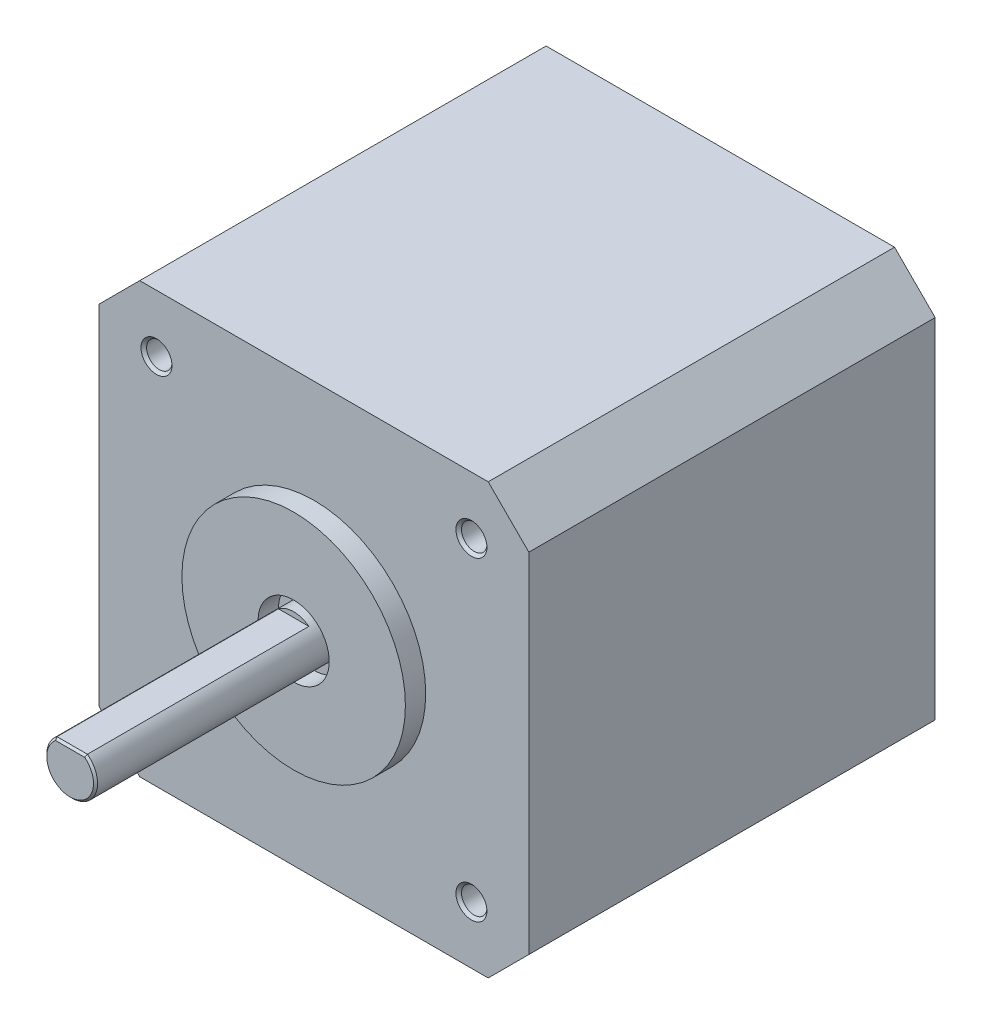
from build123d import *

# Parameters (mm, degrees)
SCHIZZO1_W                      = 42.3
SCHIZZO1_H                      = 42.3
ESTRUSIONE_ESTRUSIONE1_DEPTH    = 40
SCHIZZO2_R                      = 11
ESTRUSIONE_ESTRUSIONE2_DEPTH    = 2
SCHIZZO3_R                      = 3.5
TAGLIO_ESTRUSIONE1_DEPTH        = 2
SCHIZZO4_R                      = 2.5
ESTRUSIONE_ESTRUSIONE3_DEPTH    = 24
SCHIZZO5_W                      = 5
SCHIZZO5_H                      = 1
TAGLIO_ESTRUSIONE2_DEPTH        = 22
FORO_FILETTATO_M3_1_D           = 2.5
FORO_FILETTATO_M3_1_DEPTH       = 8.5
FORO_FILETTATO_M3_1_CSINK_D     = 3.05
FORO_FILETTATO_M3_1_CSINK_ANGLE = 90
FORO_FILETTATO_M3_1_TIP         = 0.751075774
SMUSSO1_SIZE                    = 0.2
SMUSSO2_SIZE                    = 4


with BuildPart() as part:
    # Schizzo1 → Estrusione-Estrusione1 (new body)
    with BuildSketch(Plane.XY):
        Rectangle(SCHIZZO1_W, SCHIZZO1_H)
    extrude(amount=ESTRUSIONE_ESTRUSIONE1_DEPTH)

    # Schizzo2 → Estrusione-Estrusione2 (add)
    with BuildSketch(Plane.XY.offset(40)):
        Circle(SCHIZZO2_R)
    extrude(amount=ESTRUSIONE_ESTRUSIONE2_DEPTH)

    # Schizzo3 → Taglio-Estrusione1 (cut)
    with BuildSketch(Plane.XY.offset(42)):
        Circle(SCHIZZO3_R)
    extrude(amount=-TAGLIO_ESTRUSIONE1_DEPTH, mode=Mode.SUBTRACT)

    # Schizzo4 → Estrusione-Estrusione3 (add)
    with BuildSketch(Plane.XY.offset(40)):
        Circle(SCHIZZO4_R)
    extrude(amount=ESTRUSIONE_ESTRUSIONE3_DEPTH)

    # Schizzo5 → Taglio-Estrusione2 (cut)
    with BuildSketch(Plane.XY.offset(64)):
        with Locations((0, 2.5)):
            Rectangle(SCHIZZO5_W, SCHIZZO5_H)
    extrude(amount=-TAGLIO_ESTRUSIONE2_DEPTH, mode=Mode.SUBTRACT)

    # Foro filettato M3-1
    with Locations(Plane.XY.offset(40)):
        with Locations((15.5, 15.5), (-15.5, 15.5), (-15.5, -15.5), (15.5, -15.5)):
            CounterSinkHole(FORO_FILETTATO_M3_1_D / 2, FORO_FILETTATO_M3_1_CSINK_D / 2, depth=FORO_FILETTATO_M3_1_DEPTH, counter_sink_angle=FORO_FILETTATO_M3_1_CSINK_ANGLE)
            with Locations((0, 0, -(FORO_FILETTATO_M3_1_DEPTH + FORO_FILETTATO_M3_1_TIP / 2))):  # 118° drill point
                Cone(0, FORO_FILETTATO_M3_1_D / 2, FORO_FILETTATO_M3_1_TIP, mode=Mode.SUBTRACT)

    # Smusso1
    smusso1_edges = [part.edges().sort_by_distance(p)[0] for p in [
        (-1.118033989, -2.236067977, 64),
        (0, 2, 64),
    ]]
    chamfer(smusso1_edges, length=SMUSSO1_SIZE)

    # Smusso2
    smusso2_edges = [part.edges().sort_by_distance(p)[0] for p in [
        (21.15, -21.15, 20),
        (-21.15, -21.15, 20),
        (-21.15, 21.15, 20),
        (21.15, 21.15, 20),
    ]]
    chamfer(smusso2_edges, length=SMUSSO2_SIZE)


solid = part.part
